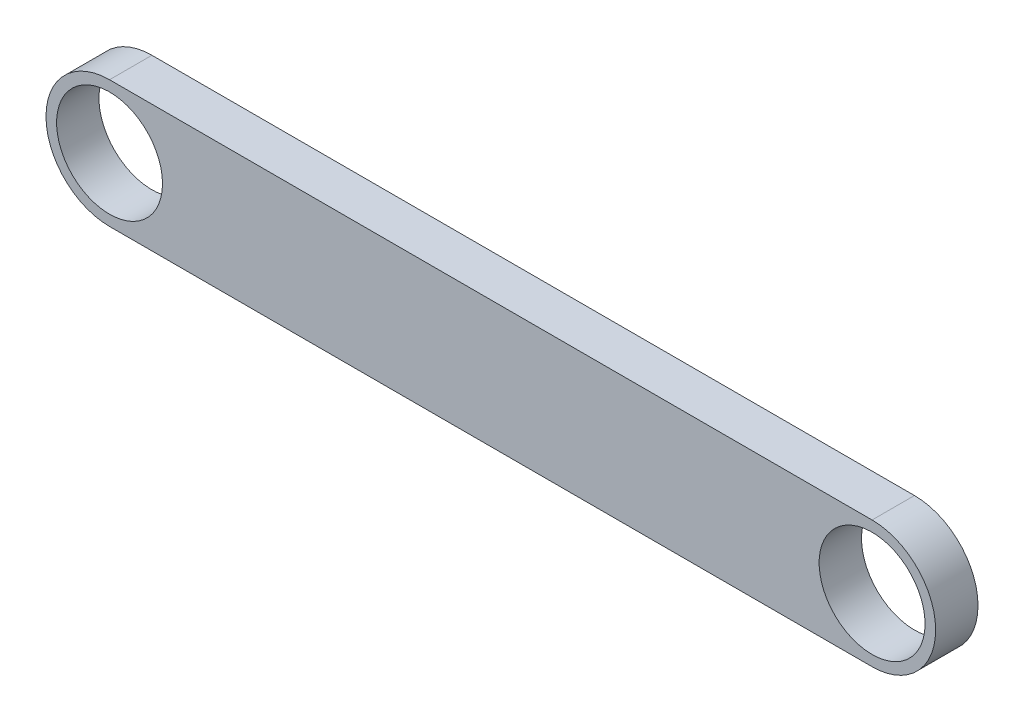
ISO-10303-21;
HEADER;
FILE_DESCRIPTION(('STEP AP214'),'2;1');
FILE_NAME('part.step','',(''),(''),'','','');
FILE_SCHEMA(('AUTOMOTIVE_DESIGN { 1 0 10303 214 1 1 1 1 }'));
ENDSEC;
DATA;
#1=APPLICATION_CONTEXT('core data for automotive mechanical design processes');
#2=APPLICATION_PROTOCOL_DEFINITION('international standard','automotive_design',2000,#1);
#3=PRODUCT_CONTEXT('',#1,'mechanical');
#4=PRODUCT('Part','Part','',(#3));
#5=PRODUCT_RELATED_PRODUCT_CATEGORY('part','',(#4));
#6=PRODUCT_DEFINITION_FORMATION('','',#4);
#7=PRODUCT_DEFINITION_CONTEXT('part definition',#1,'design');
#8=PRODUCT_DEFINITION('design','',#6,#7);
#9=PRODUCT_DEFINITION_SHAPE('','',#8);
#10=(LENGTH_UNIT() NAMED_UNIT(*) SI_UNIT(.MILLI.,.METRE.));
#11=(NAMED_UNIT(*) PLANE_ANGLE_UNIT() SI_UNIT($,.RADIAN.));
#12=(NAMED_UNIT(*) SI_UNIT($,.STERADIAN.) SOLID_ANGLE_UNIT());
#13=UNCERTAINTY_MEASURE_WITH_UNIT(LENGTH_MEASURE(1.E-05),#10,'distance_accuracy_value','');
#14=(GEOMETRIC_REPRESENTATION_CONTEXT(3) GLOBAL_UNCERTAINTY_ASSIGNED_CONTEXT((#13)) GLOBAL_UNIT_ASSIGNED_CONTEXT((#10,
#11,#12)) REPRESENTATION_CONTEXT('',''));
#15=CARTESIAN_POINT('',(0.,0.,0.));
#16=DIRECTION('',(0.,0.,1.));
#17=DIRECTION('',(1.,0.,0.));
#18=AXIS2_PLACEMENT_3D('',#15,#16,#17);
#19=CARTESIAN_POINT('',(0.,0.,10.));
#20=DIRECTION('',(0.,0.,1.));
#21=DIRECTION('',(1.,0.,0.));
#22=AXIS2_PLACEMENT_3D('',#19,#20,#21);
#23=PLANE('',#22);
#24=CARTESIAN_POINT('',(0.,0.,10.));
#25=DIRECTION('',(0.,0.,1.));
#26=DIRECTION('',(1.,0.,0.));
#27=AXIS2_PLACEMENT_3D('',#24,#25,#26);
#28=CIRCLE('',#27,12.5);
#29=CARTESIAN_POINT('',(12.5,0.,10.));
#30=VERTEX_POINT('',#29);
#31=EDGE_CURVE('E100',#30,#30,#28,.T.);
#32=ORIENTED_EDGE('',*,*,#31,.F.);
#33=EDGE_LOOP('',(#32));
#34=FACE_BOUND('',#33,.T.);
#35=CARTESIAN_POINT('',(0.,0.,10.));
#36=DIRECTION('',(0.,0.,1.));
#37=DIRECTION('',(1.,0.,0.));
#38=AXIS2_PLACEMENT_3D('',#35,#36,#37);
#39=CIRCLE('',#38,15.);
#40=CARTESIAN_POINT('',(0.,15.,10.));
#41=VERTEX_POINT('',#40);
#42=CARTESIAN_POINT('',(0.,-15.,10.));
#43=VERTEX_POINT('',#42);
#44=EDGE_CURVE('E85',#41,#43,#39,.T.);
#45=ORIENTED_EDGE('',*,*,#44,.T.);
#46=DIRECTION('',(1.,0.,0.));
#47=VECTOR('',#46,1.);
#48=CARTESIAN_POINT('',(0.,-15.,10.));
#49=LINE('',#48,#47);
#50=CARTESIAN_POINT('',(180.,-15.,10.));
#51=VERTEX_POINT('',#50);
#52=EDGE_CURVE('E80',#43,#51,#49,.T.);
#53=ORIENTED_EDGE('',*,*,#52,.T.);
#54=CARTESIAN_POINT('',(180.,0.,10.));
#55=DIRECTION('',(0.,0.,1.));
#56=DIRECTION('',(1.,0.,0.));
#57=AXIS2_PLACEMENT_3D('',#54,#55,#56);
#58=CIRCLE('',#57,15.);
#59=CARTESIAN_POINT('',(180.,15.,10.));
#60=VERTEX_POINT('',#59);
#61=EDGE_CURVE('E83',#51,#60,#58,.T.);
#62=ORIENTED_EDGE('',*,*,#61,.T.);
#63=DIRECTION('',(-1.,0.,0.));
#64=VECTOR('',#63,1.);
#65=CARTESIAN_POINT('',(0.,15.,10.));
#66=LINE('',#65,#64);
#67=EDGE_CURVE('E50',#60,#41,#66,.T.);
#68=ORIENTED_EDGE('',*,*,#67,.T.);
#69=EDGE_LOOP('',(#45,#53,#62,#68));
#70=FACE_BOUND('',#69,.T.);
#71=CARTESIAN_POINT('',(180.,0.,10.));
#72=DIRECTION('',(0.,0.,1.));
#73=DIRECTION('',(1.,0.,0.));
#74=AXIS2_PLACEMENT_3D('',#71,#72,#73);
#75=CIRCLE('',#74,12.5);
#76=CARTESIAN_POINT('',(192.5,0.,10.));
#77=VERTEX_POINT('',#76);
#78=EDGE_CURVE('E115',#77,#77,#75,.T.);
#79=ORIENTED_EDGE('',*,*,#78,.F.);
#80=EDGE_LOOP('',(#79));
#81=FACE_BOUND('',#80,.T.);
#82=ADVANCED_FACE('F33',(#34,#70,#81),#23,.T.);
#83=CARTESIAN_POINT('',(0.,0.,0.));
#84=DIRECTION('',(0.,0.,1.));
#85=DIRECTION('',(1.,0.,0.));
#86=AXIS2_PLACEMENT_3D('',#83,#84,#85);
#87=PLANE('',#86);
#88=CARTESIAN_POINT('',(0.,0.,0.));
#89=DIRECTION('',(0.,0.,1.));
#90=DIRECTION('',(1.,0.,0.));
#91=AXIS2_PLACEMENT_3D('',#88,#89,#90);
#92=CIRCLE('',#91,15.);
#93=CARTESIAN_POINT('',(0.,15.,0.));
#94=VERTEX_POINT('',#93);
#95=CARTESIAN_POINT('',(0.,-15.,0.));
#96=VERTEX_POINT('',#95);
#97=EDGE_CURVE('E97',#94,#96,#92,.T.);
#98=ORIENTED_EDGE('',*,*,#97,.F.);
#99=DIRECTION('',(-1.,0.,0.));
#100=VECTOR('',#99,1.);
#101=CARTESIAN_POINT('',(0.,15.,0.));
#102=LINE('',#101,#100);
#103=CARTESIAN_POINT('',(180.,15.,0.));
#104=VERTEX_POINT('',#103);
#105=EDGE_CURVE('E73',#104,#94,#102,.T.);
#106=ORIENTED_EDGE('',*,*,#105,.F.);
#107=CARTESIAN_POINT('',(180.,0.,0.));
#108=DIRECTION('',(0.,0.,1.));
#109=DIRECTION('',(1.,0.,0.));
#110=AXIS2_PLACEMENT_3D('',#107,#108,#109);
#111=CIRCLE('',#110,15.);
#112=CARTESIAN_POINT('',(180.,-15.,0.));
#113=VERTEX_POINT('',#112);
#114=EDGE_CURVE('E67',#113,#104,#111,.T.);
#115=ORIENTED_EDGE('',*,*,#114,.F.);
#116=DIRECTION('',(1.,0.,0.));
#117=VECTOR('',#116,1.);
#118=CARTESIAN_POINT('',(0.,-15.,0.));
#119=LINE('',#118,#117);
#120=EDGE_CURVE('E89',#96,#113,#119,.T.);
#121=ORIENTED_EDGE('',*,*,#120,.F.);
#122=EDGE_LOOP('',(#98,#106,#115,#121));
#123=FACE_BOUND('',#122,.T.);
#124=CARTESIAN_POINT('',(0.,0.,0.));
#125=DIRECTION('',(0.,0.,1.));
#126=DIRECTION('',(1.,0.,0.));
#127=AXIS2_PLACEMENT_3D('',#124,#125,#126);
#128=CIRCLE('',#127,12.5);
#129=CARTESIAN_POINT('',(12.5,0.,0.));
#130=VERTEX_POINT('',#129);
#131=EDGE_CURVE('E112',#130,#130,#128,.T.);
#132=ORIENTED_EDGE('',*,*,#131,.T.);
#133=EDGE_LOOP('',(#132));
#134=FACE_BOUND('',#133,.T.);
#135=CARTESIAN_POINT('',(180.,0.,0.));
#136=DIRECTION('',(0.,0.,1.));
#137=DIRECTION('',(1.,0.,0.));
#138=AXIS2_PLACEMENT_3D('',#135,#136,#137);
#139=CIRCLE('',#138,12.5);
#140=CARTESIAN_POINT('',(192.5,0.,0.));
#141=VERTEX_POINT('',#140);
#142=EDGE_CURVE('E118',#141,#141,#139,.T.);
#143=ORIENTED_EDGE('',*,*,#142,.T.);
#144=EDGE_LOOP('',(#143));
#145=FACE_BOUND('',#144,.T.);
#146=ADVANCED_FACE('F108',(#123,#134,#145),#87,.F.);
#147=CARTESIAN_POINT('',(0.,0.,10.));
#148=DIRECTION('',(0.,0.,-1.));
#149=DIRECTION('',(-1.,0.,0.));
#150=AXIS2_PLACEMENT_3D('',#147,#148,#149);
#151=CYLINDRICAL_SURFACE('',#150,15.);
#152=ORIENTED_EDGE('',*,*,#97,.T.);
#153=DIRECTION('',(0.,0.,-1.));
#154=VECTOR('',#153,1.);
#155=CARTESIAN_POINT('',(0.,-15.,10.));
#156=LINE('',#155,#154);
#157=EDGE_CURVE('E11',#43,#96,#156,.T.);
#158=ORIENTED_EDGE('',*,*,#157,.F.);
#159=ORIENTED_EDGE('',*,*,#44,.F.);
#160=DIRECTION('',(0.,0.,-1.));
#161=VECTOR('',#160,1.);
#162=CARTESIAN_POINT('',(0.,15.,10.));
#163=LINE('',#162,#161);
#164=EDGE_CURVE('E93',#41,#94,#163,.T.);
#165=ORIENTED_EDGE('',*,*,#164,.T.);
#166=EDGE_LOOP('',(#152,#158,#159,#165));
#167=FACE_BOUND('',#166,.T.);
#168=ADVANCED_FACE('F35',(#167),#151,.T.);
#169=CARTESIAN_POINT('',(0.,-15.,10.));
#170=DIRECTION('',(0.,1.,0.));
#171=DIRECTION('',(0.,0.,1.));
#172=AXIS2_PLACEMENT_3D('',#169,#170,#171);
#173=PLANE('',#172);
#174=ORIENTED_EDGE('',*,*,#120,.T.);
#175=DIRECTION('',(0.,0.,-1.));
#176=VECTOR('',#175,1.);
#177=CARTESIAN_POINT('',(180.,-15.,10.));
#178=LINE('',#177,#176);
#179=EDGE_CURVE('E42',#51,#113,#178,.T.);
#180=ORIENTED_EDGE('',*,*,#179,.F.);
#181=ORIENTED_EDGE('',*,*,#52,.F.);
#182=ORIENTED_EDGE('',*,*,#157,.T.);
#183=EDGE_LOOP('',(#174,#180,#181,#182));
#184=FACE_BOUND('',#183,.T.);
#185=ADVANCED_FACE('F88',(#184),#173,.F.);
#186=CARTESIAN_POINT('',(180.,0.,10.));
#187=DIRECTION('',(0.,0.,-1.));
#188=DIRECTION('',(-1.,0.,0.));
#189=AXIS2_PLACEMENT_3D('',#186,#187,#188);
#190=CYLINDRICAL_SURFACE('',#189,15.);
#191=ORIENTED_EDGE('',*,*,#114,.T.);
#192=DIRECTION('',(0.,0.,-1.));
#193=VECTOR('',#192,1.);
#194=CARTESIAN_POINT('',(180.,15.,10.));
#195=LINE('',#194,#193);
#196=EDGE_CURVE('E90',#60,#104,#195,.T.);
#197=ORIENTED_EDGE('',*,*,#196,.F.);
#198=ORIENTED_EDGE('',*,*,#61,.F.);
#199=ORIENTED_EDGE('',*,*,#179,.T.);
#200=EDGE_LOOP('',(#191,#197,#198,#199));
#201=FACE_BOUND('',#200,.T.);
#202=ADVANCED_FACE('F91',(#201),#190,.T.);
#203=CARTESIAN_POINT('',(0.,15.,10.));
#204=DIRECTION('',(0.,-1.,0.));
#205=DIRECTION('',(0.,0.,-1.));
#206=AXIS2_PLACEMENT_3D('',#203,#204,#205);
#207=PLANE('',#206);
#208=ORIENTED_EDGE('',*,*,#105,.T.);
#209=ORIENTED_EDGE('',*,*,#164,.F.);
#210=ORIENTED_EDGE('',*,*,#67,.F.);
#211=ORIENTED_EDGE('',*,*,#196,.T.);
#212=EDGE_LOOP('',(#208,#209,#210,#211));
#213=FACE_BOUND('',#212,.T.);
#214=ADVANCED_FACE('F105',(#213),#207,.F.);
#215=CARTESIAN_POINT('',(0.,0.,10.));
#216=DIRECTION('',(0.,0.,-1.));
#217=DIRECTION('',(-1.,0.,0.));
#218=AXIS2_PLACEMENT_3D('',#215,#216,#217);
#219=CYLINDRICAL_SURFACE('',#218,12.5);
#220=ORIENTED_EDGE('',*,*,#31,.T.);
#221=EDGE_LOOP('',(#220));
#222=FACE_BOUND('',#221,.T.);
#223=ORIENTED_EDGE('',*,*,#131,.F.);
#224=EDGE_LOOP('',(#223));
#225=FACE_BOUND('',#224,.T.);
#226=ADVANCED_FACE('F135',(#222,#225),#219,.F.);
#227=CARTESIAN_POINT('',(180.,0.,10.));
#228=DIRECTION('',(0.,0.,-1.));
#229=DIRECTION('',(-1.,0.,0.));
#230=AXIS2_PLACEMENT_3D('',#227,#228,#229);
#231=CYLINDRICAL_SURFACE('',#230,12.5);
#232=ORIENTED_EDGE('',*,*,#78,.T.);
#233=EDGE_LOOP('',(#232));
#234=FACE_BOUND('',#233,.T.);
#235=ORIENTED_EDGE('',*,*,#142,.F.);
#236=EDGE_LOOP('',(#235));
#237=FACE_BOUND('',#236,.T.);
#238=ADVANCED_FACE('F124',(#234,#237),#231,.F.);
#239=CLOSED_SHELL('',(#82,#146,#168,#185,#202,#214,#226,#238));
#240=MANIFOLD_SOLID_BREP('B2',#239);
#241=ADVANCED_BREP_SHAPE_REPRESENTATION('',(#18,#240),#14);
#242=SHAPE_DEFINITION_REPRESENTATION(#9,#241);
ENDSEC;
END-ISO-10303-21;
